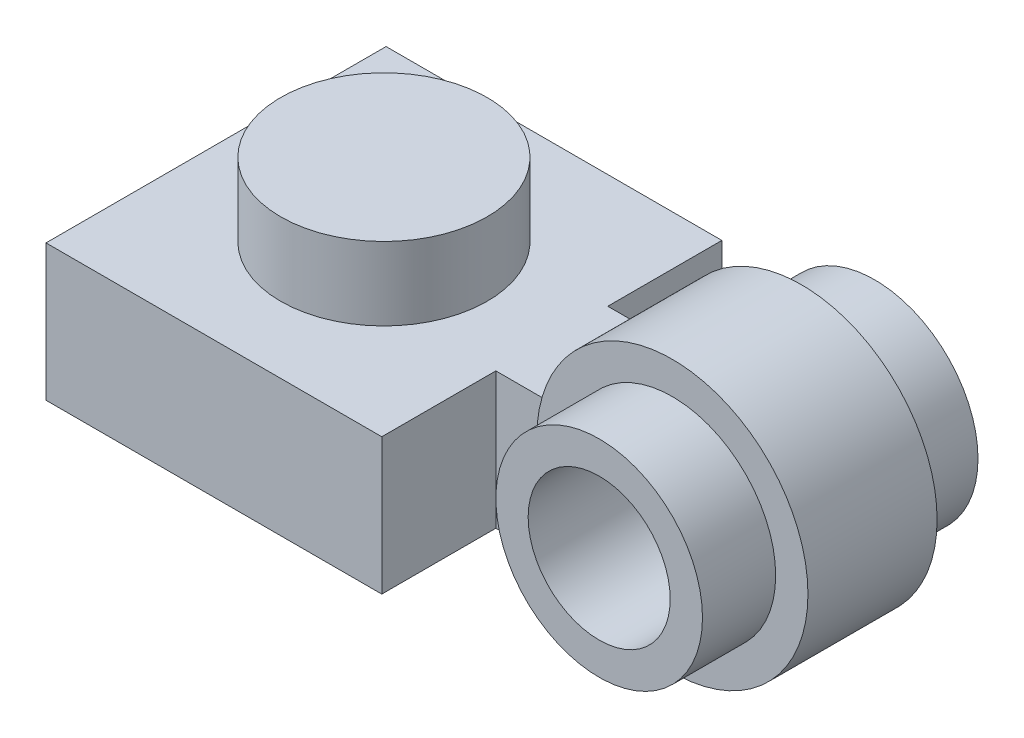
from build123d import *

# Parameters (mm, degrees)
SKETCH1_W           = 7.8
SKETCH1_H           = 7.9
EXTRUDE1_DEPTH      = 3.166
SKETCH2_R           = 2.4
EXTRUDE2_DEPTH      = 1.7
SKETCH3_W           = 4.9
SKETCH3_H           = 5
EXTRUDE3_DEPTH      = 2.5
SKETCH5_W           = 2.6
SKETCH5_H           = 3.166
BOSS_EXTRUDE2_DEPTH = 6.8
FILLET2_R           = 1
SKETCH7_R           = 3.15
BOSS_EXTRUDE5_DEPTH = 1.5
SKETCH10_R          = 2.4
BOSS_EXTRUDE6_DEPTH = 1.7
BOSS_EXTRUDE7_START = 1.7
SKETCH11_R          = 2.4
BOSS_EXTRUDE7_DEPTH = 1.7
SKETCH12_R          = 1.65
CUT_EXTRUDE2_DEPTH  = 15.555668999


with BuildPart() as part:
    # Sketch1 → Extrude1 (new body)
    with BuildSketch(Plane(origin=(0, 0, 0), x_dir=(1, 0, 0), z_dir=(0, 1, 0))):
        Rectangle(SKETCH1_W, SKETCH1_H)
    extrude(amount=EXTRUDE1_DEPTH)

    # Sketch2 → Extrude2 (add)
    with BuildSketch(Plane(origin=(0, 3.166, 0), x_dir=(1, 0, 0), z_dir=(0, 1, 0))):
        with Locations(Location((0, 0, 0), (0, 0, 270))):
            Circle(SKETCH2_R)
    extrude(amount=EXTRUDE2_DEPTH)

    # Sketch3 → Extrude3 (cut)
    with BuildSketch(Plane.XZ):
        Rectangle(SKETCH3_W, SKETCH3_H)
    extrude(amount=-EXTRUDE3_DEPTH, mode=Mode.SUBTRACT)

    # Sketch5 → Boss-Extrude2 (add)
    with BuildSketch(Plane(origin=(3.9, 0, 0), x_dir=(0, 0, -1), z_dir=(1, 0, 0))):
        with Locations((0, 1.583)):
            Rectangle(SKETCH5_W, SKETCH5_H)
    extrude(amount=BOSS_EXTRUDE2_DEPTH)

    # Fillet2
    fillet2_edges = [part.edges().sort_by_distance(p)[0] for p in [
        (10.7, 3.166, 0),
        (10.7, 0, 0),
    ]]
    fillet(fillet2_edges, radius=FILLET2_R)

    # Sketch7 → Boss-Extrude5 (add, symmetric)
    with BuildSketch(Plane.XY):
        with Locations((8.2, 2.5)):
            Circle(SKETCH7_R)
    extrude(amount=BOSS_EXTRUDE5_DEPTH, both=True)

    # Sketch10 → Boss-Extrude6 (add)
    with BuildSketch(Plane.XY.offset(1.5)):
        with Locations((8.2, 2.5)):
            Circle(SKETCH10_R)
    extrude(amount=BOSS_EXTRUDE6_DEPTH)

    # Sketch11 → Boss-Extrude7 (add)
    with BuildSketch(Plane(origin=(0, 0, -1.5), x_dir=(-1, 0, 0), z_dir=(0, 0, -1)).offset(BOSS_EXTRUDE7_START)):
        with Locations(Location((-8.2, 2.5, 0), (0, 0, 180))):
            Circle(SKETCH11_R)
    extrude(amount=-BOSS_EXTRUDE7_DEPTH)

    # Sketch12 → Cut-Extrude2 (cut, through all)
    with BuildSketch(Plane(origin=(0, 0, -3.2), x_dir=(-1, 0, 0), z_dir=(0, 0, -1))):
        with Locations((-8.2, 2.5)):
            Circle(SKETCH12_R)
    extrude(amount=-CUT_EXTRUDE2_DEPTH, mode=Mode.SUBTRACT)


solid = part.part
